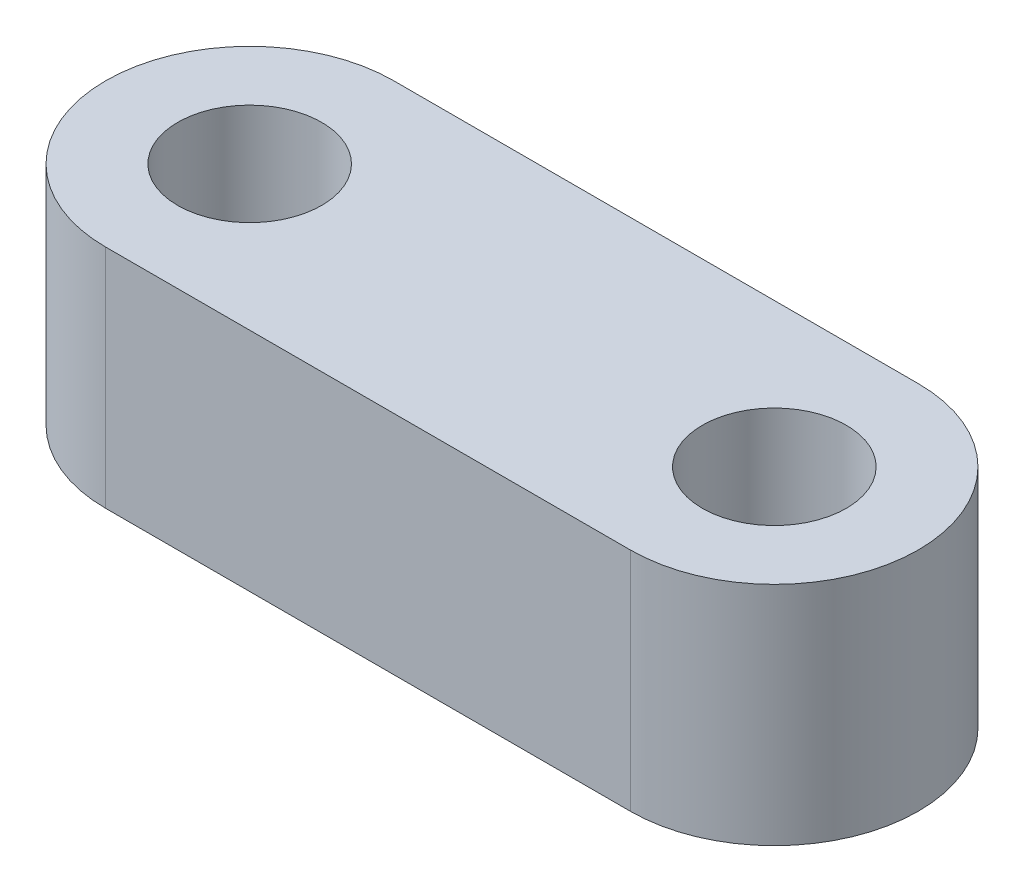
ISO-10303-21;
HEADER;
FILE_DESCRIPTION(('STEP AP214'),'2;1');
FILE_NAME('part.step','',(''),(''),'','','');
FILE_SCHEMA(('AUTOMOTIVE_DESIGN { 1 0 10303 214 1 1 1 1 }'));
ENDSEC;
DATA;
#1=APPLICATION_CONTEXT('core data for automotive mechanical design processes');
#2=APPLICATION_PROTOCOL_DEFINITION('international standard','automotive_design',2000,#1);
#3=PRODUCT_CONTEXT('',#1,'mechanical');
#4=PRODUCT('Part','Part','',(#3));
#5=PRODUCT_RELATED_PRODUCT_CATEGORY('part','',(#4));
#6=PRODUCT_DEFINITION_FORMATION('','',#4);
#7=PRODUCT_DEFINITION_CONTEXT('part definition',#1,'design');
#8=PRODUCT_DEFINITION('design','',#6,#7);
#9=PRODUCT_DEFINITION_SHAPE('','',#8);
#10=(LENGTH_UNIT() NAMED_UNIT(*) SI_UNIT(.MILLI.,.METRE.));
#11=(NAMED_UNIT(*) PLANE_ANGLE_UNIT() SI_UNIT($,.RADIAN.));
#12=(NAMED_UNIT(*) SI_UNIT($,.STERADIAN.) SOLID_ANGLE_UNIT());
#13=UNCERTAINTY_MEASURE_WITH_UNIT(LENGTH_MEASURE(1.E-05),#10,'distance_accuracy_value','');
#14=(GEOMETRIC_REPRESENTATION_CONTEXT(3) GLOBAL_UNCERTAINTY_ASSIGNED_CONTEXT((#13)) GLOBAL_UNIT_ASSIGNED_CONTEXT((#10,
#11,#12)) REPRESENTATION_CONTEXT('',''));
#15=CARTESIAN_POINT('',(0.,0.,0.));
#16=DIRECTION('',(0.,0.,1.));
#17=DIRECTION('',(1.,0.,0.));
#18=AXIS2_PLACEMENT_3D('',#15,#16,#17);
#19=CARTESIAN_POINT('',(-12.75,5.5,0.));
#20=DIRECTION('',(0.,1.,0.));
#21=DIRECTION('',(0.,0.,1.));
#22=AXIS2_PLACEMENT_3D('',#19,#20,#21);
#23=PLANE('',#22);
#24=CARTESIAN_POINT('',(-12.75,5.5,0.));
#25=DIRECTION('',(0.,1.,0.));
#26=DIRECTION('',(0.,0.,1.));
#27=AXIS2_PLACEMENT_3D('',#24,#25,#26);
#28=CIRCLE('',#27,1.75);
#29=CARTESIAN_POINT('',(-12.75,5.5,1.75));
#30=VERTEX_POINT('',#29);
#31=EDGE_CURVE('E103',#30,#30,#28,.T.);
#32=ORIENTED_EDGE('',*,*,#31,.F.);
#33=EDGE_LOOP('',(#32));
#34=FACE_BOUND('',#33,.T.);
#35=CARTESIAN_POINT('',(-12.75,5.5,0.));
#36=DIRECTION('',(0.,1.,0.));
#37=DIRECTION('',(0.,0.,1.));
#38=AXIS2_PLACEMENT_3D('',#35,#36,#37);
#39=CIRCLE('',#38,3.5);
#40=CARTESIAN_POINT('',(-12.75,5.5,-3.5));
#41=VERTEX_POINT('',#40);
#42=CARTESIAN_POINT('',(-12.75,5.5,3.5));
#43=VERTEX_POINT('',#42);
#44=EDGE_CURVE('E88',#41,#43,#39,.T.);
#45=ORIENTED_EDGE('',*,*,#44,.T.);
#46=DIRECTION('',(1.,0.,0.));
#47=VECTOR('',#46,1.);
#48=CARTESIAN_POINT('',(0.,5.5,3.5));
#49=LINE('',#48,#47);
#50=CARTESIAN_POINT('',(0.,5.5,3.5));
#51=VERTEX_POINT('',#50);
#52=EDGE_CURVE('E83',#43,#51,#49,.T.);
#53=ORIENTED_EDGE('',*,*,#52,.T.);
#54=CARTESIAN_POINT('',(0.,5.5,0.));
#55=DIRECTION('',(0.,1.,0.));
#56=DIRECTION('',(0.,0.,1.));
#57=AXIS2_PLACEMENT_3D('',#54,#55,#56);
#58=CIRCLE('',#57,3.5);
#59=CARTESIAN_POINT('',(0.,5.5,-3.5));
#60=VERTEX_POINT('',#59);
#61=EDGE_CURVE('E86',#51,#60,#58,.T.);
#62=ORIENTED_EDGE('',*,*,#61,.T.);
#63=DIRECTION('',(-1.,0.,0.));
#64=VECTOR('',#63,1.);
#65=CARTESIAN_POINT('',(-12.75,5.5,-3.5));
#66=LINE('',#65,#64);
#67=EDGE_CURVE('E53',#60,#41,#66,.T.);
#68=ORIENTED_EDGE('',*,*,#67,.T.);
#69=EDGE_LOOP('',(#45,#53,#62,#68));
#70=FACE_BOUND('',#69,.T.);
#71=CARTESIAN_POINT('',(0.,5.5,0.));
#72=DIRECTION('',(0.,1.,0.));
#73=DIRECTION('',(0.,0.,1.));
#74=AXIS2_PLACEMENT_3D('',#71,#72,#73);
#75=CIRCLE('',#74,1.75);
#76=CARTESIAN_POINT('',(0.,5.5,1.75));
#77=VERTEX_POINT('',#76);
#78=EDGE_CURVE('E118',#77,#77,#75,.T.);
#79=ORIENTED_EDGE('',*,*,#78,.F.);
#80=EDGE_LOOP('',(#79));
#81=FACE_BOUND('',#80,.T.);
#82=ADVANCED_FACE('F36',(#34,#70,#81),#23,.T.);
#83=CARTESIAN_POINT('',(-12.75,0.,0.));
#84=DIRECTION('',(0.,1.,0.));
#85=DIRECTION('',(0.,0.,1.));
#86=AXIS2_PLACEMENT_3D('',#83,#84,#85);
#87=PLANE('',#86);
#88=CARTESIAN_POINT('',(-12.75,0.,0.));
#89=DIRECTION('',(0.,1.,0.));
#90=DIRECTION('',(0.,0.,1.));
#91=AXIS2_PLACEMENT_3D('',#88,#89,#90);
#92=CIRCLE('',#91,3.5);
#93=CARTESIAN_POINT('',(-12.75,0.,-3.5));
#94=VERTEX_POINT('',#93);
#95=CARTESIAN_POINT('',(-12.75,0.,3.5));
#96=VERTEX_POINT('',#95);
#97=EDGE_CURVE('E100',#94,#96,#92,.T.);
#98=ORIENTED_EDGE('',*,*,#97,.F.);
#99=DIRECTION('',(-1.,0.,0.));
#100=VECTOR('',#99,1.);
#101=CARTESIAN_POINT('',(-12.75,0.,-3.5));
#102=LINE('',#101,#100);
#103=CARTESIAN_POINT('',(0.,0.,-3.5));
#104=VERTEX_POINT('',#103);
#105=EDGE_CURVE('E76',#104,#94,#102,.T.);
#106=ORIENTED_EDGE('',*,*,#105,.F.);
#107=CARTESIAN_POINT('',(0.,0.,0.));
#108=DIRECTION('',(0.,1.,0.));
#109=DIRECTION('',(0.,0.,1.));
#110=AXIS2_PLACEMENT_3D('',#107,#108,#109);
#111=CIRCLE('',#110,3.5);
#112=CARTESIAN_POINT('',(0.,0.,3.5));
#113=VERTEX_POINT('',#112);
#114=EDGE_CURVE('E70',#113,#104,#111,.T.);
#115=ORIENTED_EDGE('',*,*,#114,.F.);
#116=DIRECTION('',(1.,0.,0.));
#117=VECTOR('',#116,1.);
#118=CARTESIAN_POINT('',(0.,0.,3.5));
#119=LINE('',#118,#117);
#120=EDGE_CURVE('E92',#96,#113,#119,.T.);
#121=ORIENTED_EDGE('',*,*,#120,.F.);
#122=EDGE_LOOP('',(#98,#106,#115,#121));
#123=FACE_BOUND('',#122,.T.);
#124=CARTESIAN_POINT('',(-12.75,0.,0.));
#125=DIRECTION('',(0.,1.,0.));
#126=DIRECTION('',(0.,0.,1.));
#127=AXIS2_PLACEMENT_3D('',#124,#125,#126);
#128=CIRCLE('',#127,1.75);
#129=CARTESIAN_POINT('',(-12.75,0.,1.75));
#130=VERTEX_POINT('',#129);
#131=EDGE_CURVE('E115',#130,#130,#128,.T.);
#132=ORIENTED_EDGE('',*,*,#131,.T.);
#133=EDGE_LOOP('',(#132));
#134=FACE_BOUND('',#133,.T.);
#135=CARTESIAN_POINT('',(0.,0.,0.));
#136=DIRECTION('',(0.,1.,0.));
#137=DIRECTION('',(0.,0.,1.));
#138=AXIS2_PLACEMENT_3D('',#135,#136,#137);
#139=CIRCLE('',#138,1.75);
#140=CARTESIAN_POINT('',(0.,0.,1.75));
#141=VERTEX_POINT('',#140);
#142=EDGE_CURVE('E121',#141,#141,#139,.T.);
#143=ORIENTED_EDGE('',*,*,#142,.T.);
#144=EDGE_LOOP('',(#143));
#145=FACE_BOUND('',#144,.T.);
#146=ADVANCED_FACE('F111',(#123,#134,#145),#87,.F.);
#147=CARTESIAN_POINT('',(-12.75,5.5,0.));
#148=DIRECTION('',(0.,-1.,0.));
#149=DIRECTION('',(0.,0.,-1.));
#150=AXIS2_PLACEMENT_3D('',#147,#148,#149);
#151=CYLINDRICAL_SURFACE('',#150,3.5);
#152=ORIENTED_EDGE('',*,*,#97,.T.);
#153=DIRECTION('',(0.,-1.,0.));
#154=VECTOR('',#153,1.);
#155=CARTESIAN_POINT('',(-12.75,5.5,3.5));
#156=LINE('',#155,#154);
#157=EDGE_CURVE('E11',#43,#96,#156,.T.);
#158=ORIENTED_EDGE('',*,*,#157,.F.);
#159=ORIENTED_EDGE('',*,*,#44,.F.);
#160=DIRECTION('',(0.,-1.,0.));
#161=VECTOR('',#160,1.);
#162=CARTESIAN_POINT('',(-12.75,5.5,-3.5));
#163=LINE('',#162,#161);
#164=EDGE_CURVE('E96',#41,#94,#163,.T.);
#165=ORIENTED_EDGE('',*,*,#164,.T.);
#166=EDGE_LOOP('',(#152,#158,#159,#165));
#167=FACE_BOUND('',#166,.T.);
#168=ADVANCED_FACE('F38',(#167),#151,.T.);
#169=CARTESIAN_POINT('',(0.,5.5,3.5));
#170=DIRECTION('',(0.,0.,-1.));
#171=DIRECTION('',(-1.,0.,0.));
#172=AXIS2_PLACEMENT_3D('',#169,#170,#171);
#173=PLANE('',#172);
#174=ORIENTED_EDGE('',*,*,#120,.T.);
#175=DIRECTION('',(0.,-1.,0.));
#176=VECTOR('',#175,1.);
#177=CARTESIAN_POINT('',(0.,5.5,3.5));
#178=LINE('',#177,#176);
#179=EDGE_CURVE('E45',#51,#113,#178,.T.);
#180=ORIENTED_EDGE('',*,*,#179,.F.);
#181=ORIENTED_EDGE('',*,*,#52,.F.);
#182=ORIENTED_EDGE('',*,*,#157,.T.);
#183=EDGE_LOOP('',(#174,#180,#181,#182));
#184=FACE_BOUND('',#183,.T.);
#185=ADVANCED_FACE('F91',(#184),#173,.F.);
#186=CARTESIAN_POINT('',(0.,5.5,0.));
#187=DIRECTION('',(0.,-1.,0.));
#188=DIRECTION('',(0.,0.,-1.));
#189=AXIS2_PLACEMENT_3D('',#186,#187,#188);
#190=CYLINDRICAL_SURFACE('',#189,3.5);
#191=ORIENTED_EDGE('',*,*,#114,.T.);
#192=DIRECTION('',(0.,-1.,0.));
#193=VECTOR('',#192,1.);
#194=CARTESIAN_POINT('',(0.,5.5,-3.5));
#195=LINE('',#194,#193);
#196=EDGE_CURVE('E93',#60,#104,#195,.T.);
#197=ORIENTED_EDGE('',*,*,#196,.F.);
#198=ORIENTED_EDGE('',*,*,#61,.F.);
#199=ORIENTED_EDGE('',*,*,#179,.T.);
#200=EDGE_LOOP('',(#191,#197,#198,#199));
#201=FACE_BOUND('',#200,.T.);
#202=ADVANCED_FACE('F94',(#201),#190,.T.);
#203=CARTESIAN_POINT('',(-12.75,5.5,-3.5));
#204=DIRECTION('',(0.,0.,1.));
#205=DIRECTION('',(1.,0.,0.));
#206=AXIS2_PLACEMENT_3D('',#203,#204,#205);
#207=PLANE('',#206);
#208=ORIENTED_EDGE('',*,*,#105,.T.);
#209=ORIENTED_EDGE('',*,*,#164,.F.);
#210=ORIENTED_EDGE('',*,*,#67,.F.);
#211=ORIENTED_EDGE('',*,*,#196,.T.);
#212=EDGE_LOOP('',(#208,#209,#210,#211));
#213=FACE_BOUND('',#212,.T.);
#214=ADVANCED_FACE('F108',(#213),#207,.F.);
#215=CARTESIAN_POINT('',(-12.75,5.5,0.));
#216=DIRECTION('',(0.,-1.,0.));
#217=DIRECTION('',(0.,0.,-1.));
#218=AXIS2_PLACEMENT_3D('',#215,#216,#217);
#219=CYLINDRICAL_SURFACE('',#218,1.75);
#220=ORIENTED_EDGE('',*,*,#31,.T.);
#221=EDGE_LOOP('',(#220));
#222=FACE_BOUND('',#221,.T.);
#223=ORIENTED_EDGE('',*,*,#131,.F.);
#224=EDGE_LOOP('',(#223));
#225=FACE_BOUND('',#224,.T.);
#226=ADVANCED_FACE('F138',(#222,#225),#219,.F.);
#227=CARTESIAN_POINT('',(0.,5.5,0.));
#228=DIRECTION('',(0.,-1.,0.));
#229=DIRECTION('',(0.,0.,-1.));
#230=AXIS2_PLACEMENT_3D('',#227,#228,#229);
#231=CYLINDRICAL_SURFACE('',#230,1.75);
#232=ORIENTED_EDGE('',*,*,#78,.T.);
#233=EDGE_LOOP('',(#232));
#234=FACE_BOUND('',#233,.T.);
#235=ORIENTED_EDGE('',*,*,#142,.F.);
#236=EDGE_LOOP('',(#235));
#237=FACE_BOUND('',#236,.T.);
#238=ADVANCED_FACE('F127',(#234,#237),#231,.F.);
#239=CLOSED_SHELL('',(#82,#146,#168,#185,#202,#214,#226,#238));
#240=MANIFOLD_SOLID_BREP('B2',#239);
#241=ADVANCED_BREP_SHAPE_REPRESENTATION('',(#18,#240),#14);
#242=SHAPE_DEFINITION_REPRESENTATION(#9,#241);
ENDSEC;
END-ISO-10303-21;
